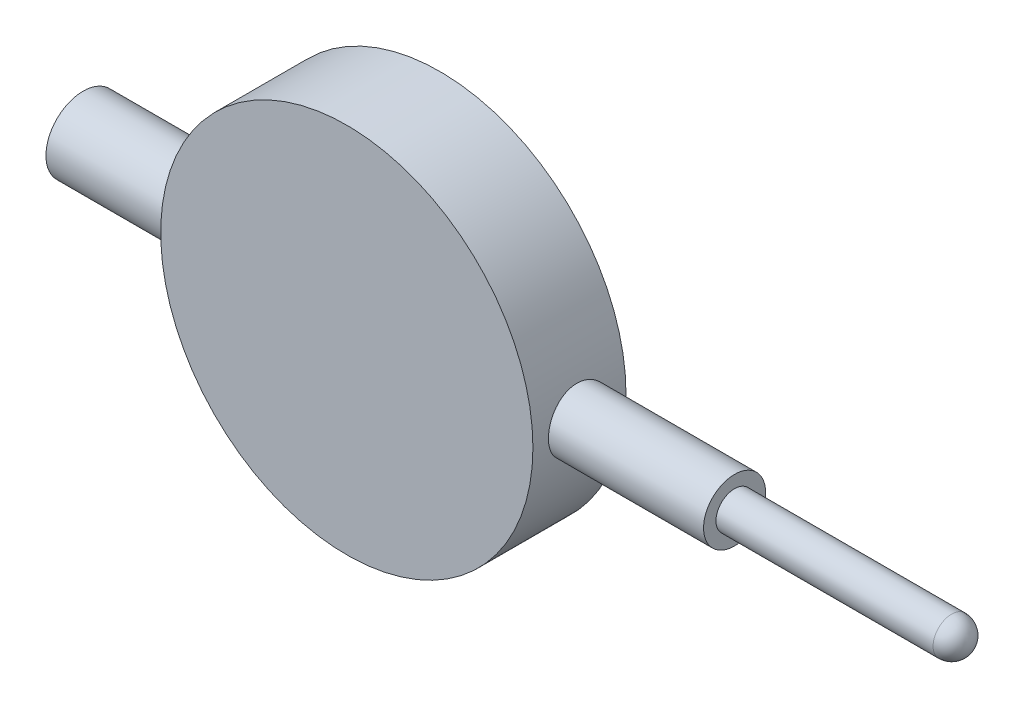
ISO-10303-21;
HEADER;
FILE_DESCRIPTION(('STEP AP214'),'2;1');
FILE_NAME('part.step','',(''),(''),'','','');
FILE_SCHEMA(('AUTOMOTIVE_DESIGN { 1 0 10303 214 1 1 1 1 }'));
ENDSEC;
DATA;
#1=APPLICATION_CONTEXT('core data for automotive mechanical design processes');
#2=APPLICATION_PROTOCOL_DEFINITION('international standard','automotive_design',2000,#1);
#3=PRODUCT_CONTEXT('',#1,'mechanical');
#4=PRODUCT('Part','Part','',(#3));
#5=PRODUCT_RELATED_PRODUCT_CATEGORY('part','',(#4));
#6=PRODUCT_DEFINITION_FORMATION('','',#4);
#7=PRODUCT_DEFINITION_CONTEXT('part definition',#1,'design');
#8=PRODUCT_DEFINITION('design','',#6,#7);
#9=PRODUCT_DEFINITION_SHAPE('','',#8);
#10=(LENGTH_UNIT() NAMED_UNIT(*) SI_UNIT(.MILLI.,.METRE.));
#11=(NAMED_UNIT(*) PLANE_ANGLE_UNIT() SI_UNIT($,.RADIAN.));
#12=(NAMED_UNIT(*) SI_UNIT($,.STERADIAN.) SOLID_ANGLE_UNIT());
#13=UNCERTAINTY_MEASURE_WITH_UNIT(LENGTH_MEASURE(1.E-05),#10,'distance_accuracy_value','');
#14=(GEOMETRIC_REPRESENTATION_CONTEXT(3) GLOBAL_UNCERTAINTY_ASSIGNED_CONTEXT((#13)) GLOBAL_UNIT_ASSIGNED_CONTEXT((#10,
#11,#12)) REPRESENTATION_CONTEXT('',''));
#15=CARTESIAN_POINT('',(0.,0.,0.));
#16=DIRECTION('',(0.,0.,1.));
#17=DIRECTION('',(1.,0.,0.));
#18=AXIS2_PLACEMENT_3D('',#15,#16,#17);
#19=CARTESIAN_POINT('',(90.,0.,7.5));
#20=DIRECTION('',(0.,0.479425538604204,0.877582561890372));
#21=DIRECTION('',(0.,0.877582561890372,-0.479425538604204));
#22=AXIS2_PLACEMENT_3D('',#19,#20,#21);
#23=SPHERICAL_SURFACE('',#22,3.);
#24=CARTESIAN_POINT('',(90.,0.,7.5));
#25=DIRECTION('',(1.,0.,0.));
#26=DIRECTION('',(0.,0.,-1.));
#27=AXIS2_PLACEMENT_3D('',#24,#25,#26);
#28=CIRCLE('',#27,3.);
#29=CARTESIAN_POINT('',(90.,-1.43827661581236,4.86725231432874));
#30=VERTEX_POINT('',#29);
#31=CARTESIAN_POINT('',(90.,1.43827661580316,10.1327476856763));
#32=VERTEX_POINT('',#31);
#33=EDGE_CURVE('E34',#30,#32,#28,.F.);
#34=ORIENTED_EDGE('',*,*,#33,.F.);
#35=CARTESIAN_POINT('',(90.,0.,7.5));
#36=DIRECTION('',(1.,0.,0.));
#37=DIRECTION('',(0.,0.,-1.));
#38=AXIS2_PLACEMENT_3D('',#35,#36,#37);
#39=CIRCLE('',#38,3.);
#40=EDGE_CURVE('E32',#32,#30,#39,.F.);
#41=ORIENTED_EDGE('',*,*,#40,.F.);
#42=EDGE_LOOP('',(#34,#41));
#43=FACE_BOUND('',#42,.T.);
#44=ADVANCED_FACE('F16',(#43),#23,.T.);
#45=CARTESIAN_POINT('',(72.5,0.,7.5));
#46=DIRECTION('',(1.,0.,0.));
#47=DIRECTION('',(0.,0.,-1.));
#48=AXIS2_PLACEMENT_3D('',#45,#46,#47);
#49=CYLINDRICAL_SURFACE('',#48,3.);
#50=CARTESIAN_POINT('',(55.,0.,7.5));
#51=DIRECTION('',(1.,0.,0.));
#52=DIRECTION('',(0.,0.,-1.));
#53=AXIS2_PLACEMENT_3D('',#50,#51,#52);
#54=CIRCLE('',#53,3.);
#55=CARTESIAN_POINT('',(55.,0.,4.5));
#56=VERTEX_POINT('',#55);
#57=EDGE_CURVE('E20',#56,#56,#54,.F.);
#58=ORIENTED_EDGE('',*,*,#57,.F.);
#59=EDGE_LOOP('',(#58));
#60=FACE_BOUND('',#59,.T.);
#61=ORIENTED_EDGE('',*,*,#40,.T.);
#62=ORIENTED_EDGE('',*,*,#33,.T.);
#63=EDGE_LOOP('',(#61,#62));
#64=FACE_BOUND('',#63,.T.);
#65=ADVANCED_FACE('F35',(#60,#64),#49,.T.);
#66=CARTESIAN_POINT('',(-50.,0.,0.));
#67=DIRECTION('',(1.,0.,0.));
#68=DIRECTION('',(0.,0.,-1.));
#69=AXIS2_PLACEMENT_3D('',#66,#67,#68);
#70=PLANE('',#69);
#71=CARTESIAN_POINT('',(-50.,0.,7.5));
#72=DIRECTION('',(1.,0.,0.));
#73=DIRECTION('',(0.,0.,-1.));
#74=AXIS2_PLACEMENT_3D('',#71,#72,#73);
#75=CIRCLE('',#74,6.);
#76=CARTESIAN_POINT('',(-50.,0.,1.5));
#77=VERTEX_POINT('',#76);
#78=EDGE_CURVE('E88',#77,#77,#75,.T.);
#79=ORIENTED_EDGE('',*,*,#78,.F.);
#80=EDGE_LOOP('',(#79));
#81=FACE_BOUND('',#80,.T.);
#82=ADVANCED_FACE('F99',(#81),#70,.F.);
#83=CARTESIAN_POINT('',(55.,0.,0.));
#84=DIRECTION('',(1.,0.,0.));
#85=DIRECTION('',(0.,0.,-1.));
#86=AXIS2_PLACEMENT_3D('',#83,#84,#85);
#87=PLANE('',#86);
#88=ORIENTED_EDGE('',*,*,#57,.T.);
#89=EDGE_LOOP('',(#88));
#90=FACE_BOUND('',#89,.T.);
#91=CARTESIAN_POINT('',(55.,0.,7.5));
#92=DIRECTION('',(1.,0.,0.));
#93=DIRECTION('',(0.,0.,-1.));
#94=AXIS2_PLACEMENT_3D('',#91,#92,#93);
#95=CIRCLE('',#94,5.);
#96=CARTESIAN_POINT('',(55.,0.,2.5));
#97=VERTEX_POINT('',#96);
#98=EDGE_CURVE('E85',#97,#97,#95,.F.);
#99=ORIENTED_EDGE('',*,*,#98,.F.);
#100=EDGE_LOOP('',(#99));
#101=FACE_BOUND('',#100,.T.);
#102=ADVANCED_FACE('F96',(#90,#101),#87,.T.);
#103=CARTESIAN_POINT('',(0.,0.,15.));
#104=DIRECTION('',(0.,0.,1.));
#105=DIRECTION('',(1.,0.,0.));
#106=AXIS2_PLACEMENT_3D('',#103,#104,#105);
#107=PLANE('',#106);
#108=CARTESIAN_POINT('',(0.,0.,15.));
#109=DIRECTION('',(0.,0.,1.));
#110=DIRECTION('',(1.,0.,0.));
#111=AXIS2_PLACEMENT_3D('',#108,#109,#110);
#112=CIRCLE('',#111,30.);
#113=CARTESIAN_POINT('',(30.,0.,15.));
#114=VERTEX_POINT('',#113);
#115=EDGE_CURVE('E87',#114,#114,#112,.F.);
#116=ORIENTED_EDGE('',*,*,#115,.F.);
#117=EDGE_LOOP('',(#116));
#118=FACE_BOUND('',#117,.T.);
#119=ADVANCED_FACE('F81',(#118),#107,.T.);
#120=CARTESIAN_POINT('',(-37.5,0.,7.5));
#121=DIRECTION('',(1.,0.,0.));
#122=DIRECTION('',(0.,0.,-1.));
#123=AXIS2_PLACEMENT_3D('',#120,#121,#122);
#124=CYLINDRICAL_SURFACE('',#123,6.);
#125=ORIENTED_EDGE('',*,*,#78,.T.);
#126=EDGE_LOOP('',(#125));
#127=FACE_BOUND('',#126,.T.);
#128=CARTESIAN_POINT('',(-30.,0.,13.5));
#129=CARTESIAN_POINT('',(-30.0000011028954,-0.166756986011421,13.5000021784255));
#130=CARTESIAN_POINT('',(-29.9986069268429,-0.333483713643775,13.493045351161));
#131=CARTESIAN_POINT('',(-29.9930713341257,-0.665785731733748,13.4652764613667));
#132=CARTESIAN_POINT('',(-29.9889293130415,-0.831360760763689,13.4444613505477));
#133=CARTESIAN_POINT('',(-29.978007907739,-1.16023167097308,13.3891162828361));
#134=CARTESIAN_POINT('',(-29.9712266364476,-1.32352583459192,13.3545765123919));
#135=CARTESIAN_POINT('',(-29.9552137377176,-1.64661626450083,13.272041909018));
#136=CARTESIAN_POINT('',(-29.9459812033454,-1.80641121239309,13.2240420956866));
#137=CARTESIAN_POINT('',(-29.9253357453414,-2.12110796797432,13.11503163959));
#138=CARTESIAN_POINT('',(-29.9139259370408,-2.27601640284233,13.0540395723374));
#139=CARTESIAN_POINT('',(-29.8892328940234,-2.58013370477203,12.9194651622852));
#140=CARTESIAN_POINT('',(-29.8759489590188,-2.72934041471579,12.8458781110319));
#141=CARTESIAN_POINT('',(-29.8338324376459,-3.16668396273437,12.6070754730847));
#142=CARTESIAN_POINT('',(-29.8027087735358,-3.44492600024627,12.4236855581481));
#143=CARTESIAN_POINT('',(-29.7373261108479,-3.97021135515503,12.0111305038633));
#144=CARTESIAN_POINT('',(-29.7030338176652,-4.21683780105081,11.7814398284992));
#145=CARTESIAN_POINT('',(-29.6523501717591,-4.55534992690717,11.4085928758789));
#146=CARTESIAN_POINT('',(-29.6355703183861,-4.66301159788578,11.27949506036));
#147=CARTESIAN_POINT('',(-29.6027272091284,-4.86715660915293,11.0126852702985));
#148=CARTESIAN_POINT('',(-29.5866636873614,-4.96364411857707,10.8749765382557));
#149=CARTESIAN_POINT('',(-29.5555529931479,-5.14566877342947,10.5904542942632));
#150=CARTESIAN_POINT('',(-29.5405174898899,-5.23108773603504,10.4435639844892));
#151=CARTESIAN_POINT('',(-29.512083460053,-5.3891910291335,10.1429983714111));
#152=CARTESIAN_POINT('',(-29.49868432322,-5.46188011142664,9.98932562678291));
#153=CARTESIAN_POINT('',(-29.4739239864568,-5.59395405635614,9.67635019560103));
#154=CARTESIAN_POINT('',(-29.4625611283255,-5.65334975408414,9.51705221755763));
#155=CARTESIAN_POINT('',(-29.4422028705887,-5.75843267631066,9.1939074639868));
#156=CARTESIAN_POINT('',(-29.4332068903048,-5.80412326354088,9.03006181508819));
#157=CARTESIAN_POINT('',(-29.4151801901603,-5.89491745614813,8.64125504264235));
#158=CARTESIAN_POINT('',(-29.4072278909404,-5.93427796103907,8.41487711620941));
#159=CARTESIAN_POINT('',(-29.3965771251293,-5.98681744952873,7.95898030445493));
#160=CARTESIAN_POINT('',(-29.393878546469,-5.99999699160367,7.72946148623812));
#161=CARTESIAN_POINT('',(-29.3938757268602,-6.00000218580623,7.33328049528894));
#162=CARTESIAN_POINT('',(-29.3952982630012,-5.99304845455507,7.16659125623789));
#163=CARTESIAN_POINT('',(-29.4009438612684,-5.96529223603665,6.83436523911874));
#164=CARTESIAN_POINT('',(-29.4051675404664,-5.94448669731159,6.66882872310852));
#165=CARTESIAN_POINT('',(-29.4162964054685,-5.88916782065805,6.3400357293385));
#166=CARTESIAN_POINT('',(-29.4232035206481,-5.85464461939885,6.1767809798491));
#167=CARTESIAN_POINT('',(-29.4394979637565,-5.77215089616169,5.85377024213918));
#168=CARTESIAN_POINT('',(-29.4488862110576,-5.7241753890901,5.69401557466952));
#169=CARTESIAN_POINT('',(-29.4698546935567,-5.61522363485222,5.37940450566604));
#170=CARTESIAN_POINT('',(-29.481431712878,-5.55426644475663,5.22454130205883));
#171=CARTESIAN_POINT('',(-29.506452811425,-5.4197701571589,4.92051063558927));
#172=CARTESIAN_POINT('',(-29.5198975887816,-5.34622635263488,4.77134532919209));
#173=CARTESIAN_POINT('',(-29.5624592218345,-5.10756359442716,4.3341147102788));
#174=CARTESIAN_POINT('',(-29.5938301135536,-4.92428103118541,4.05593448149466));
#175=CARTESIAN_POINT('',(-29.6595216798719,-4.51183583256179,3.53058346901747));
#176=CARTESIAN_POINT('',(-29.6938745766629,-4.28212353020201,3.2838481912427));
#177=CARTESIAN_POINT('',(-29.7444768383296,-3.90920982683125,2.94517759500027));
#178=CARTESIAN_POINT('',(-29.7612006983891,-3.78008448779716,2.83746416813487));
#179=CARTESIAN_POINT('',(-29.7938819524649,-3.51320903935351,2.63321951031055));
#180=CARTESIAN_POINT('',(-29.8098396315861,-3.37546218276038,2.53668410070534));
#181=CARTESIAN_POINT('',(-29.8406930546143,-3.09090868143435,2.35460427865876));
#182=CARTESIAN_POINT('',(-29.8555772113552,-2.94402812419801,2.26917354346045));
#183=CARTESIAN_POINT('',(-29.8836874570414,-2.643480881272,2.11104570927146));
#184=CARTESIAN_POINT('',(-29.8969141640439,-2.48981675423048,2.0383438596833));
#185=CARTESIAN_POINT('',(-29.9213283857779,-2.17685855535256,1.90624381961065));
#186=CARTESIAN_POINT('',(-29.9325175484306,-2.01756915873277,1.84683486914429));
#187=CARTESIAN_POINT('',(-29.9525470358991,-1.69444373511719,1.74172524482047));
#188=CARTESIAN_POINT('',(-29.9613879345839,-1.5306088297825,1.69602122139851));
#189=CARTESIAN_POINT('',(-29.9790988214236,-1.1417211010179,1.60516887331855));
#190=CARTESIAN_POINT('',(-29.9869031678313,-0.915249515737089,1.56577580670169));
#191=CARTESIAN_POINT('',(-29.9973529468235,-0.459166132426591,1.51319312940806));
#192=CARTESIAN_POINT('',(-29.9999984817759,-0.22955439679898,1.50000299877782));
#193=CARTESIAN_POINT('',(-30.0000011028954,0.166756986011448,1.4999978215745));
#194=CARTESIAN_POINT('',(-29.9986069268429,0.333483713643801,1.50695464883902));
#195=CARTESIAN_POINT('',(-29.9930713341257,0.665785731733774,1.53472353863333));
#196=CARTESIAN_POINT('',(-29.9889293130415,0.831360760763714,1.55553864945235));
#197=CARTESIAN_POINT('',(-29.978007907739,1.16023167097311,1.6108837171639));
#198=CARTESIAN_POINT('',(-29.9712266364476,1.32352583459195,1.64542348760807));
#199=CARTESIAN_POINT('',(-29.9552137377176,1.64661626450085,1.72795809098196));
#200=CARTESIAN_POINT('',(-29.9459812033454,1.80641121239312,1.77595790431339));
#201=CARTESIAN_POINT('',(-29.9253357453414,2.12110796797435,1.88496836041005));
#202=CARTESIAN_POINT('',(-29.9139259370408,2.27601640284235,1.94596042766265));
#203=CARTESIAN_POINT('',(-29.8892328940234,2.58013370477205,2.08053483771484));
#204=CARTESIAN_POINT('',(-29.8759489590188,2.72934041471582,2.15412188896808));
#205=CARTESIAN_POINT('',(-29.8338324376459,3.16668396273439,2.39292452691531));
#206=CARTESIAN_POINT('',(-29.8027087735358,3.44492600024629,2.57631444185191));
#207=CARTESIAN_POINT('',(-29.7373261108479,3.97021135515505,2.98886949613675));
#208=CARTESIAN_POINT('',(-29.7030338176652,4.21683780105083,3.21856017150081));
#209=CARTESIAN_POINT('',(-29.6523501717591,4.55534992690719,3.59140712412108));
#210=CARTESIAN_POINT('',(-29.6355703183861,4.66301159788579,3.72050493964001));
#211=CARTESIAN_POINT('',(-29.6027272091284,4.86715660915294,3.98731472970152));
#212=CARTESIAN_POINT('',(-29.5866636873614,4.96364411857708,4.12502346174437));
#213=CARTESIAN_POINT('',(-29.5555529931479,5.14566877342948,4.40954570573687));
#214=CARTESIAN_POINT('',(-29.5405174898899,5.23108773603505,4.55643601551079));
#215=CARTESIAN_POINT('',(-29.512083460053,5.38919102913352,4.85700162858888));
#216=CARTESIAN_POINT('',(-29.49868432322,5.46188011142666,5.01067437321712));
#217=CARTESIAN_POINT('',(-29.4739239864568,5.59395405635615,5.32364980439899));
#218=CARTESIAN_POINT('',(-29.4625611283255,5.65334975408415,5.48294778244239));
#219=CARTESIAN_POINT('',(-29.4422028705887,5.75843267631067,5.80609253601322));
#220=CARTESIAN_POINT('',(-29.4332068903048,5.80412326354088,5.96993818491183));
#221=CARTESIAN_POINT('',(-29.4151801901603,5.89491745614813,6.35874495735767));
#222=CARTESIAN_POINT('',(-29.4072278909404,5.93427796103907,6.5851228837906));
#223=CARTESIAN_POINT('',(-29.3965771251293,5.98681744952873,7.04101969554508));
#224=CARTESIAN_POINT('',(-29.393878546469,5.99999699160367,7.27053851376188));
#225=CARTESIAN_POINT('',(-29.3938757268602,6.00000218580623,7.66671950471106));
#226=CARTESIAN_POINT('',(-29.3952982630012,5.99304845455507,7.83340874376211));
#227=CARTESIAN_POINT('',(-29.4009438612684,5.96529223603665,8.16563476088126));
#228=CARTESIAN_POINT('',(-29.4051675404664,5.94448669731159,8.33117127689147));
#229=CARTESIAN_POINT('',(-29.4162964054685,5.88916782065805,8.6599642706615));
#230=CARTESIAN_POINT('',(-29.4232035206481,5.85464461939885,8.8232190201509));
#231=CARTESIAN_POINT('',(-29.4394979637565,5.77215089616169,9.14622975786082));
#232=CARTESIAN_POINT('',(-29.4488862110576,5.7241753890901,9.30598442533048));
#233=CARTESIAN_POINT('',(-29.4698546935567,5.61522363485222,9.62059549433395));
#234=CARTESIAN_POINT('',(-29.481431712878,5.55426644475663,9.77545869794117));
#235=CARTESIAN_POINT('',(-29.506452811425,5.4197701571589,10.0794893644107));
#236=CARTESIAN_POINT('',(-29.5198975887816,5.34622635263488,10.2286546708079));
#237=CARTESIAN_POINT('',(-29.5624592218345,5.10756359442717,10.6658852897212));
#238=CARTESIAN_POINT('',(-29.5938301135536,4.92428103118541,10.9440655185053));
#239=CARTESIAN_POINT('',(-29.6595216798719,4.51183583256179,11.4694165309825));
#240=CARTESIAN_POINT('',(-29.6938745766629,4.28212353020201,11.7161518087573));
#241=CARTESIAN_POINT('',(-29.7444768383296,3.90920982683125,12.0548224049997));
#242=CARTESIAN_POINT('',(-29.7612006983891,3.78008448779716,12.1625358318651));
#243=CARTESIAN_POINT('',(-29.7938819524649,3.51320903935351,12.3667804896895));
#244=CARTESIAN_POINT('',(-29.8098396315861,3.37546218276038,12.4633158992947));
#245=CARTESIAN_POINT('',(-29.8406930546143,3.09090868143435,12.6453957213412));
#246=CARTESIAN_POINT('',(-29.8555772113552,2.94402812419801,12.7308264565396));
#247=CARTESIAN_POINT('',(-29.8836874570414,2.643480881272,12.8889542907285));
#248=CARTESIAN_POINT('',(-29.8969141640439,2.48981675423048,12.9616561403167));
#249=CARTESIAN_POINT('',(-29.9213283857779,2.17685855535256,13.0937561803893));
#250=CARTESIAN_POINT('',(-29.9325175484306,2.01756915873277,13.1531651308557));
#251=CARTESIAN_POINT('',(-29.9525470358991,1.69444373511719,13.2582747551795));
#252=CARTESIAN_POINT('',(-29.9613879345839,1.5306088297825,13.3039787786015));
#253=CARTESIAN_POINT('',(-29.9790988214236,1.14172110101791,13.3948311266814));
#254=CARTESIAN_POINT('',(-29.9869031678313,0.915249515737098,13.4342241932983));
#255=CARTESIAN_POINT('',(-29.9973529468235,0.459166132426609,13.4868068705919));
#256=CARTESIAN_POINT('',(-29.9999984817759,0.229554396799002,13.4999970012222));
#257=CARTESIAN_POINT('',(-30.,0.,13.5));
#258=B_SPLINE_CURVE_WITH_KNOTS('',3,(#128,#129,#130,#131,#132,#133,#134,#135,#136,#137,#138,
#139,#140,#141,#142,#143,#144,#145,#146,#147,#148,#149,#150,#151,#152,#153,#154,#155,#156,#157,
#158,#159,#160,#161,#162,#163,#164,#165,#166,#167,#168,#169,#170,#171,#172,#173,#174,#175,#176,
#177,#178,#179,#180,#181,#182,#183,#184,#185,#186,#187,#188,#189,#190,#191,#192,#193,#194,#195,
#196,#197,#198,#199,#200,#201,#202,#203,#204,#205,#206,#207,#208,#209,#210,#211,#212,#213,#214,
#215,#216,#217,#218,#219,#220,#221,#222,#223,#224,#225,#226,#227,#228,#229,#230,#231,#232,#233,
#234,#235,#236,#237,#238,#239,#240,#241,#242,#243,#244,#245,#246,#247,#248,#249,#250,#251,#252,
#253,#254,#255,#256,#257),.UNSPECIFIED.,.T.,.F.,(4,2,2,2,2,2,2,2,2,2,2,2,2,2,2,2,2,2,2,2,2,2,2,
2,2,2,2,2,2,2,2,2,2,2,2,2,2,2,2,2,2,2,2,2,2,2,2,2,2,2,2,2,2,2,2,2,2,2,2,2,2,2,2,2,4),(0.,
0.500068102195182,1.00024623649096,1.50078265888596,2.00150453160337,2.50151525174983,
3.00171330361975,4.00090930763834,5.01215947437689,5.51847056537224,6.02459213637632,
6.53573680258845,7.04669026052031,7.55722572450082,8.06763581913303,8.75575556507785,
9.44386063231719,9.94381614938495,10.4438818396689,10.9443077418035,11.4449193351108,
11.9448010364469,12.4448700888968,13.4438129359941,14.455358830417,14.9618146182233,
15.4680804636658,15.9791775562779,16.4900834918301,17.0005743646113,17.5109403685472,
18.1993379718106,18.8877219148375,19.3877900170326,19.8879681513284,20.3885045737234,
20.8892264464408,21.3892371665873,21.8894352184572,22.8886312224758,23.8998813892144,
24.4061924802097,24.9123140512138,25.4234587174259,25.9344121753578,26.4449476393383,
26.9553577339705,27.6434774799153,28.3315825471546,28.8315380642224,29.3316037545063,
29.8320296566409,30.3326412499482,30.8325229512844,31.3325920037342,32.3315348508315,
33.3430807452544,33.8495365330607,34.3558023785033,34.8668994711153,35.3778054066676,
35.8882962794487,36.3986622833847,37.087059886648,37.7754438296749),.UNSPECIFIED.);
#259=CARTESIAN_POINT('',(-30.,0.,13.5));
#260=VERTEX_POINT('',#259);
#261=EDGE_CURVE('E51',#260,#260,#258,.T.);
#262=ORIENTED_EDGE('',*,*,#261,.F.);
#263=EDGE_LOOP('',(#262));
#264=FACE_BOUND('',#263,.T.);
#265=ADVANCED_FACE('F76',(#127,#264),#124,.T.);
#266=CARTESIAN_POINT('',(40.,0.,7.5));
#267=DIRECTION('',(1.,0.,0.));
#268=DIRECTION('',(0.,0.,-1.));
#269=AXIS2_PLACEMENT_3D('',#266,#267,#268);
#270=CYLINDRICAL_SURFACE('',#269,5.);
#271=ORIENTED_EDGE('',*,*,#98,.T.);
#272=EDGE_LOOP('',(#271));
#273=FACE_BOUND('',#272,.T.);
#274=CARTESIAN_POINT('',(29.5803989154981,5.,7.5));
#275=CARTESIAN_POINT('',(29.5803981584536,5.00000165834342,7.36059021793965));
#276=CARTESIAN_POINT('',(29.581386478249,4.99416724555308,7.22120427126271));
#277=CARTESIAN_POINT('',(29.5853094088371,4.97087654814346,6.94339032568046));
#278=CARTESIAN_POINT('',(29.5882444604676,4.95341763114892,6.80496255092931));
#279=CARTESIAN_POINT('',(29.5959793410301,4.90699072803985,6.53000081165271));
#280=CARTESIAN_POINT('',(29.6007805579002,4.87801417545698,6.39346833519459));
#281=CARTESIAN_POINT('',(29.6121093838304,4.80876365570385,6.12332099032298));
#282=CARTESIAN_POINT('',(29.6186376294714,4.76848552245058,5.98970721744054));
#283=CARTESIAN_POINT('',(29.6332230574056,4.67698985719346,5.7265456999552));
#284=CARTESIAN_POINT('',(29.6412783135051,4.62578609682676,5.59699306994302));
#285=CARTESIAN_POINT('',(29.6586914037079,4.51279100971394,5.34266107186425));
#286=CARTESIAN_POINT('',(29.6680497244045,4.45099572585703,5.21788350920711));
#287=CARTESIAN_POINT('',(29.6976789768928,4.25043414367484,4.85218046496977));
#288=CARTESIAN_POINT('',(29.7195234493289,4.09637715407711,4.61955533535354));
#289=CARTESIAN_POINT('',(29.7651719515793,3.75034267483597,4.18133232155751));
#290=CARTESIAN_POINT('',(29.7889914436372,3.55804543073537,3.97598851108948));
#291=CARTESIAN_POINT('',(29.8240579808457,3.24601010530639,3.69432711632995));
#292=CARTESIAN_POINT('',(29.8356439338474,3.13798626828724,3.60478111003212));
#293=CARTESIAN_POINT('',(29.8582757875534,2.91477742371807,3.43506488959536));
#294=CARTESIAN_POINT('',(29.8693218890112,2.79959511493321,3.35489117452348));
#295=CARTESIAN_POINT('',(29.8906380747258,2.56204510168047,3.20397056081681));
#296=CARTESIAN_POINT('',(29.900902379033,2.43963390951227,3.13329138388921));
#297=CARTESIAN_POINT('',(29.9202771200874,2.18924104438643,3.00253822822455));
#298=CARTESIAN_POINT('',(29.9293879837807,2.061261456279,2.94246032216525));
#299=CARTESIAN_POINT('',(29.9461936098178,1.8006977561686,2.83337190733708));
#300=CARTESIAN_POINT('',(29.9538895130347,1.66811745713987,2.78435247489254));
#301=CARTESIAN_POINT('',(29.967652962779,1.39925068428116,2.697703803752));
#302=CARTESIAN_POINT('',(29.9737209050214,1.26296511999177,2.66007179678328));
#303=CARTESIAN_POINT('',(29.9858019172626,0.941068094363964,2.58572367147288));
#304=CARTESIAN_POINT('',(29.9911039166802,0.754347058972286,2.55361190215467));
#305=CARTESIAN_POINT('',(29.9982024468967,0.378402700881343,2.51075133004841));
#306=CARTESIAN_POINT('',(29.9999990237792,0.189179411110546,2.50000224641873));
#307=CARTESIAN_POINT('',(30.000000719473,-0.139424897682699,2.49999834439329));
#308=CARTESIAN_POINT('',(29.9990261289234,-0.278825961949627,2.50583401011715));
#309=CARTESIAN_POINT('',(29.9951564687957,-0.55667055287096,2.52912983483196));
#310=CARTESIAN_POINT('',(29.9922609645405,-0.695113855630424,2.54659262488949));
#311=CARTESIAN_POINT('',(29.9846265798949,-0.970107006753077,2.59303012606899));
#312=CARTESIAN_POINT('',(29.9798863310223,-1.10665537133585,2.62201338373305));
#313=CARTESIAN_POINT('',(29.9686939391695,-1.37683483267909,2.69128044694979));
#314=CARTESIAN_POINT('',(29.962241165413,-1.51046483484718,2.73156841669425));
#315=CARTESIAN_POINT('',(29.9478124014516,-1.77366087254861,2.82308784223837));
#316=CARTESIAN_POINT('',(29.9398383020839,-1.90323172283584,2.87430572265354));
#317=CARTESIAN_POINT('',(29.9225844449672,-2.1575985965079,2.98733243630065));
#318=CARTESIAN_POINT('',(29.9133041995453,-2.28239281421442,3.04914522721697));
#319=CARTESIAN_POINT('',(29.883890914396,-2.64814122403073,3.24976342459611));
#320=CARTESIAN_POINT('',(29.8621662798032,-2.88079109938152,3.40386385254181));
#321=CARTESIAN_POINT('',(29.8166637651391,-3.31898720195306,3.74994251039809));
#322=CARTESIAN_POINT('',(29.7928700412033,-3.52428696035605,3.94223074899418));
#323=CARTESIAN_POINT('',(29.7577592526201,-3.80588434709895,4.25423874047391));
#324=CARTESIAN_POINT('',(29.7461446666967,-3.89540947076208,4.36225134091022));
#325=CARTESIAN_POINT('',(29.7234317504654,-4.06508553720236,4.58543346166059));
#326=CARTESIAN_POINT('',(29.7123332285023,-4.14523997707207,4.70060028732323));
#327=CARTESIAN_POINT('',(29.6908916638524,-4.29613862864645,4.93813789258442));
#328=CARTESIAN_POINT('',(29.6805544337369,-4.36681326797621,5.06055333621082));
#329=CARTESIAN_POINT('',(29.6610240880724,-4.49755690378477,5.31095431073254));
#330=CARTESIAN_POINT('',(29.651830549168,-4.55762982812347,5.43893775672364));
#331=CARTESIAN_POINT('',(29.6348592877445,-4.66670798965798,5.69950920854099));
#332=CARTESIAN_POINT('',(29.6270804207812,-4.71572218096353,5.83209338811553));
#333=CARTESIAN_POINT('',(29.6131601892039,-4.80236021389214,6.10096880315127));
#334=CARTESIAN_POINT('',(29.6070184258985,-4.83998682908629,6.23725912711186));
#335=CARTESIAN_POINT('',(29.5947873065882,-4.91431138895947,6.55912329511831));
#336=CARTESIAN_POINT('',(29.58941523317,-4.94640993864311,6.7458059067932));
#337=CARTESIAN_POINT('',(29.5822215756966,-4.98925297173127,7.12167366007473));
#338=CARTESIAN_POINT('',(29.580399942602,-4.99999775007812,7.31085876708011));
#339=CARTESIAN_POINT('',(29.5803981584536,-5.00000165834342,7.63940978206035));
#340=CARTESIAN_POINT('',(29.581386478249,-4.99416724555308,7.77879572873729));
#341=CARTESIAN_POINT('',(29.5853094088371,-4.97087654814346,8.05660967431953));
#342=CARTESIAN_POINT('',(29.5882444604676,-4.95341763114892,8.19503744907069));
#343=CARTESIAN_POINT('',(29.5959793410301,-4.90699072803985,8.46999918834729));
#344=CARTESIAN_POINT('',(29.6007805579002,-4.87801417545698,8.6065316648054));
#345=CARTESIAN_POINT('',(29.6121093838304,-4.80876365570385,8.87667900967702));
#346=CARTESIAN_POINT('',(29.6186376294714,-4.76848552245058,9.01029278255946));
#347=CARTESIAN_POINT('',(29.6332230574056,-4.67698985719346,9.2734543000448));
#348=CARTESIAN_POINT('',(29.6412783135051,-4.62578609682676,9.40300693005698));
#349=CARTESIAN_POINT('',(29.6586914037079,-4.51279100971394,9.65733892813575));
#350=CARTESIAN_POINT('',(29.6680497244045,-4.45099572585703,9.78211649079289));
#351=CARTESIAN_POINT('',(29.6976789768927,-4.25043414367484,10.1478195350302));
#352=CARTESIAN_POINT('',(29.7195234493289,-4.09637715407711,10.3804446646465));
#353=CARTESIAN_POINT('',(29.7651719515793,-3.75034267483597,10.8186676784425));
#354=CARTESIAN_POINT('',(29.7889914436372,-3.55804543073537,11.0240114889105));
#355=CARTESIAN_POINT('',(29.8240579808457,-3.24601010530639,11.30567288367));
#356=CARTESIAN_POINT('',(29.8356439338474,-3.13798626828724,11.3952188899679));
#357=CARTESIAN_POINT('',(29.8582757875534,-2.91477742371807,11.5649351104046));
#358=CARTESIAN_POINT('',(29.8693218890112,-2.79959511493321,11.6451088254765));
#359=CARTESIAN_POINT('',(29.8906380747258,-2.56204510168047,11.7960294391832));
#360=CARTESIAN_POINT('',(29.900902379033,-2.43963390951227,11.8667086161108));
#361=CARTESIAN_POINT('',(29.9202771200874,-2.18924104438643,11.9974617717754));
#362=CARTESIAN_POINT('',(29.9293879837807,-2.061261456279,12.0575396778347));
#363=CARTESIAN_POINT('',(29.9461936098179,-1.8006977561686,12.1666280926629));
#364=CARTESIAN_POINT('',(29.9538895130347,-1.66811745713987,12.2156475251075));
#365=CARTESIAN_POINT('',(29.967652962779,-1.39925068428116,12.302296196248));
#366=CARTESIAN_POINT('',(29.9737209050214,-1.26296511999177,12.3399282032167));
#367=CARTESIAN_POINT('',(29.9858019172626,-0.941068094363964,12.4142763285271));
#368=CARTESIAN_POINT('',(29.9911039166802,-0.754347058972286,12.4463880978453));
#369=CARTESIAN_POINT('',(29.9982024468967,-0.378402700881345,12.4892486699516));
#370=CARTESIAN_POINT('',(29.9999990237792,-0.189179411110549,12.4999977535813));
#371=CARTESIAN_POINT('',(30.000000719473,0.139424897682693,12.5000016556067));
#372=CARTESIAN_POINT('',(29.9990261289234,0.278825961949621,12.4941659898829));
#373=CARTESIAN_POINT('',(29.9951564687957,0.556670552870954,12.470870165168));
#374=CARTESIAN_POINT('',(29.9922609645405,0.695113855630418,12.4534073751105));
#375=CARTESIAN_POINT('',(29.9846265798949,0.970107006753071,12.406969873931));
#376=CARTESIAN_POINT('',(29.9798863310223,1.10665537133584,12.377986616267));
#377=CARTESIAN_POINT('',(29.9686939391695,1.37683483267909,12.3087195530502));
#378=CARTESIAN_POINT('',(29.962241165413,1.51046483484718,12.2684315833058));
#379=CARTESIAN_POINT('',(29.9478124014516,1.77366087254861,12.1769121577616));
#380=CARTESIAN_POINT('',(29.9398383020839,1.90323172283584,12.1256942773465));
#381=CARTESIAN_POINT('',(29.9225844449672,2.15759859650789,12.0126675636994));
#382=CARTESIAN_POINT('',(29.9133041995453,2.28239281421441,11.950854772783));
#383=CARTESIAN_POINT('',(29.883890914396,2.64814122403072,11.7502365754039));
#384=CARTESIAN_POINT('',(29.8621662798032,2.88079109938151,11.5961361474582));
#385=CARTESIAN_POINT('',(29.8166637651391,3.31898720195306,11.2500574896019));
#386=CARTESIAN_POINT('',(29.7928700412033,3.52428696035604,11.0577692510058));
#387=CARTESIAN_POINT('',(29.7577592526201,3.80588434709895,10.7457612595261));
#388=CARTESIAN_POINT('',(29.7461446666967,3.89540947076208,10.6377486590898));
#389=CARTESIAN_POINT('',(29.7234317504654,4.06508553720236,10.4145665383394));
#390=CARTESIAN_POINT('',(29.7123332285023,4.14523997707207,10.2993997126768));
#391=CARTESIAN_POINT('',(29.6908916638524,4.29613862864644,10.0618621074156));
#392=CARTESIAN_POINT('',(29.6805544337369,4.36681326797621,9.93944666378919));
#393=CARTESIAN_POINT('',(29.6610240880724,4.49755690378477,9.68904568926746));
#394=CARTESIAN_POINT('',(29.651830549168,4.55762982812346,9.56106224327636));
#395=CARTESIAN_POINT('',(29.6348592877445,4.66670798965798,9.30049079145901));
#396=CARTESIAN_POINT('',(29.6270804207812,4.71572218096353,9.16790661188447));
#397=CARTESIAN_POINT('',(29.6131601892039,4.80236021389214,8.89903119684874));
#398=CARTESIAN_POINT('',(29.6070184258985,4.83998682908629,8.76274087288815));
#399=CARTESIAN_POINT('',(29.5947873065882,4.91431138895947,8.44087670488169));
#400=CARTESIAN_POINT('',(29.58941523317,4.94640993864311,8.25419409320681));
#401=CARTESIAN_POINT('',(29.5822215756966,4.98925297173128,7.87832633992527));
#402=CARTESIAN_POINT('',(29.580399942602,4.99999775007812,7.68914123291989));
#403=CARTESIAN_POINT('',(29.5803989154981,5.,7.5));
#404=B_SPLINE_CURVE_WITH_KNOTS('',3,(#274,#275,#276,#277,#278,#279,#280,#281,#282,#283,#284,
#285,#286,#287,#288,#289,#290,#291,#292,#293,#294,#295,#296,#297,#298,#299,#300,#301,#302,#303,
#304,#305,#306,#307,#308,#309,#310,#311,#312,#313,#314,#315,#316,#317,#318,#319,#320,#321,#322,
#323,#324,#325,#326,#327,#328,#329,#330,#331,#332,#333,#334,#335,#336,#337,#338,#339,#340,#341,
#342,#343,#344,#345,#346,#347,#348,#349,#350,#351,#352,#353,#354,#355,#356,#357,#358,#359,#360,
#361,#362,#363,#364,#365,#366,#367,#368,#369,#370,#371,#372,#373,#374,#375,#376,#377,#378,#379,
#380,#381,#382,#383,#384,#385,#386,#387,#388,#389,#390,#391,#392,#393,#394,#395,#396,#397,#398,
#399,#400,#401,#402,#403),.UNSPECIFIED.,.T.,.F.,(4,2,2,2,2,2,2,2,2,2,2,2,2,2,2,2,2,2,2,2,2,2,2,
2,2,2,2,2,2,2,2,2,2,2,2,2,2,2,2,2,2,2,2,2,2,2,2,2,2,2,2,2,2,2,2,2,2,2,2,2,2,2,2,2,4),(0.,
0.418062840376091,0.836220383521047,1.2546895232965,1.67331312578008,2.0914121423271,
2.50966770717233,3.34514405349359,4.18792477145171,4.60988224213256,5.0316815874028,
5.45634564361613,5.88085204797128,6.30501466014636,6.72907407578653,7.29639391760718,
7.8637063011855,8.28181454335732,8.70001743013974,9.11853114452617,9.53719922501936,
9.95535029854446,10.3736579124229,11.20923639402,12.0518978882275,12.4737970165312,
12.8955381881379,13.3202224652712,13.7447490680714,14.1689306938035,14.5930089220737,
15.1602145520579,15.7274123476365,16.1454751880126,16.5636327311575,16.982101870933,
17.4007254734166,17.8188244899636,18.2370800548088,19.0725564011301,19.9153371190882,
20.3372945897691,20.7590939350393,21.1837579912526,21.6082643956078,22.0324270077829,
22.456486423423,23.0238062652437,23.591118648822,24.0092268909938,24.4274297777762,
24.8459434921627,25.2646115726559,25.682762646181,26.1010702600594,26.9366487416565,
27.779310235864,28.2012093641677,28.6229505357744,29.0476348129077,29.4721614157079,
29.89634304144,30.3204212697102,30.8876268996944,31.454824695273),.UNSPECIFIED.);
#405=CARTESIAN_POINT('',(29.5803989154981,5.,7.5));
#406=VERTEX_POINT('',#405);
#407=EDGE_CURVE('E25',#406,#406,#404,.T.);
#408=ORIENTED_EDGE('',*,*,#407,.F.);
#409=EDGE_LOOP('',(#408));
#410=FACE_BOUND('',#409,.T.);
#411=ADVANCED_FACE('F56',(#273,#410),#270,.T.);
#412=CARTESIAN_POINT('',(0.,0.,7.5));
#413=DIRECTION('',(0.,0.,1.));
#414=DIRECTION('',(1.,0.,0.));
#415=AXIS2_PLACEMENT_3D('',#412,#413,#414);
#416=CYLINDRICAL_SURFACE('',#415,30.);
#417=ORIENTED_EDGE('',*,*,#115,.T.);
#418=EDGE_LOOP('',(#417));
#419=FACE_BOUND('',#418,.T.);
#420=ORIENTED_EDGE('',*,*,#261,.T.);
#421=EDGE_LOOP('',(#420));
#422=FACE_BOUND('',#421,.T.);
#423=CARTESIAN_POINT('',(0.,0.,0.));
#424=DIRECTION('',(0.,0.,1.));
#425=DIRECTION('',(1.,0.,0.));
#426=AXIS2_PLACEMENT_3D('',#423,#424,#425);
#427=CIRCLE('',#426,30.);
#428=CARTESIAN_POINT('',(30.,0.,0.));
#429=VERTEX_POINT('',#428);
#430=EDGE_CURVE('E10',#429,#429,#427,.T.);
#431=ORIENTED_EDGE('',*,*,#430,.T.);
#432=EDGE_LOOP('',(#431));
#433=FACE_BOUND('',#432,.T.);
#434=ORIENTED_EDGE('',*,*,#407,.T.);
#435=EDGE_LOOP('',(#434));
#436=FACE_BOUND('',#435,.T.);
#437=ADVANCED_FACE('F58',(#419,#422,#433,#436),#416,.T.);
#438=CARTESIAN_POINT('',(0.,0.,0.));
#439=DIRECTION('',(0.,0.,1.));
#440=DIRECTION('',(1.,0.,0.));
#441=AXIS2_PLACEMENT_3D('',#438,#439,#440);
#442=PLANE('',#441);
#443=ORIENTED_EDGE('',*,*,#430,.F.);
#444=EDGE_LOOP('',(#443));
#445=FACE_BOUND('',#444,.T.);
#446=ADVANCED_FACE('F62',(#445),#442,.F.);
#447=CLOSED_SHELL('',(#44,#65,#82,#102,#119,#265,#411,#437,#446));
#448=MANIFOLD_SOLID_BREP('B1',#447);
#449=ADVANCED_BREP_SHAPE_REPRESENTATION('',(#18,#448),#14);
#450=SHAPE_DEFINITION_REPRESENTATION(#9,#449);
ENDSEC;
END-ISO-10303-21;
